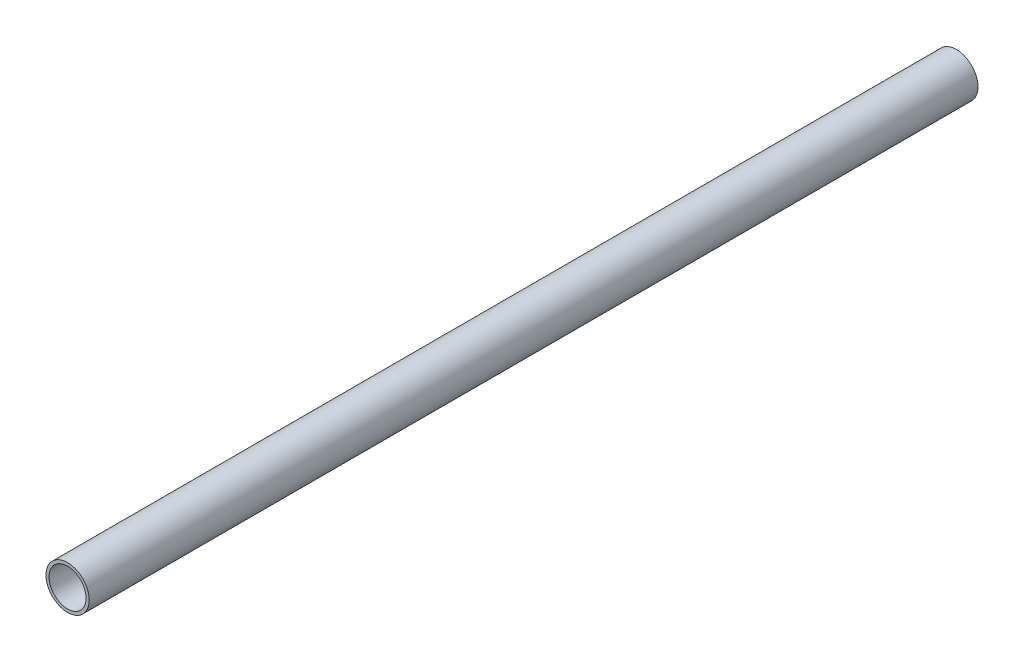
from build123d import *

# Parameters (mm, degrees)
SKETCH1_R           = 11.1125
SKETCH1_R_2         = 9.525
EXTRUDE_THIN1_DEPTH = 457.2


with BuildPart() as part:
    # Sketch1 → Extrude-Thin1 (new body)
    with BuildSketch(Plane.XY):
        Circle(SKETCH1_R)
        Circle(SKETCH1_R_2, mode=Mode.SUBTRACT)
    extrude(amount=-EXTRUDE_THIN1_DEPTH)


solid = part.part
